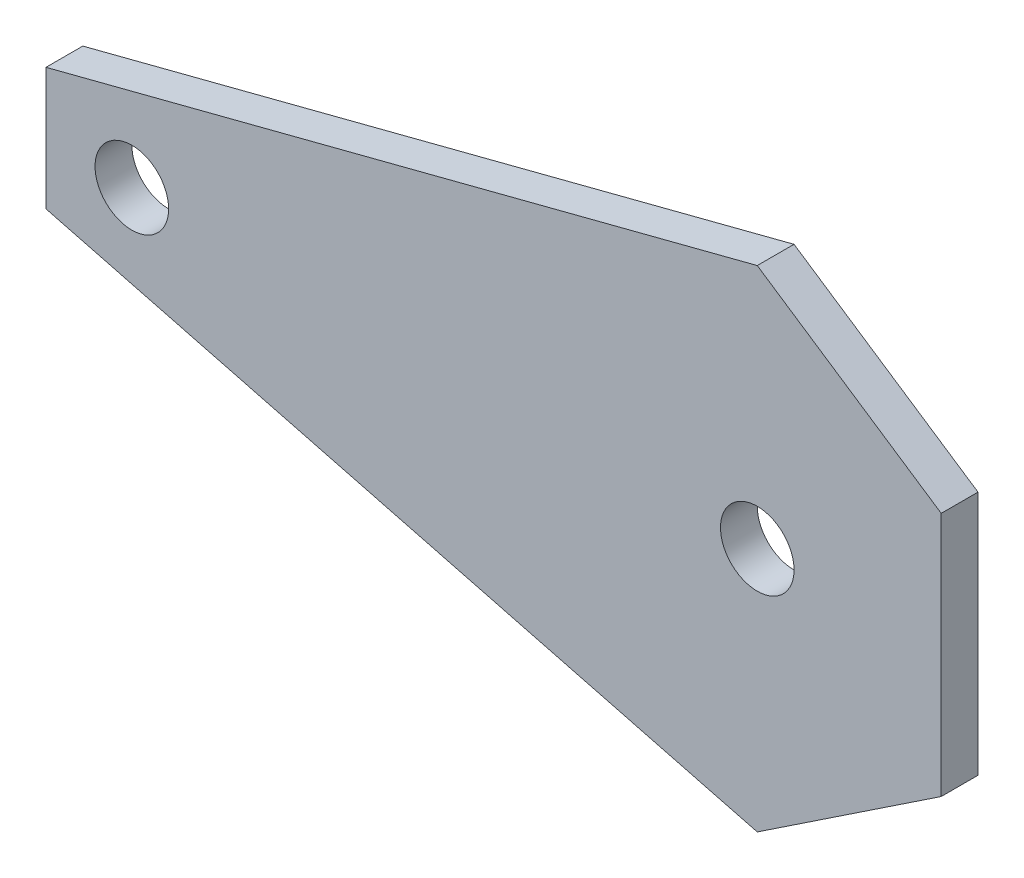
ISO-10303-21;
HEADER;
FILE_DESCRIPTION(('STEP AP214'),'2;1');
FILE_NAME('part.step','',(''),(''),'','','');
FILE_SCHEMA(('AUTOMOTIVE_DESIGN { 1 0 10303 214 1 1 1 1 }'));
ENDSEC;
DATA;
#1=APPLICATION_CONTEXT('core data for automotive mechanical design processes');
#2=APPLICATION_PROTOCOL_DEFINITION('international standard','automotive_design',2000,#1);
#3=PRODUCT_CONTEXT('',#1,'mechanical');
#4=PRODUCT('Part','Part','',(#3));
#5=PRODUCT_RELATED_PRODUCT_CATEGORY('part','',(#4));
#6=PRODUCT_DEFINITION_FORMATION('','',#4);
#7=PRODUCT_DEFINITION_CONTEXT('part definition',#1,'design');
#8=PRODUCT_DEFINITION('design','',#6,#7);
#9=PRODUCT_DEFINITION_SHAPE('','',#8);
#10=(LENGTH_UNIT() NAMED_UNIT(*) SI_UNIT(.MILLI.,.METRE.));
#11=(NAMED_UNIT(*) PLANE_ANGLE_UNIT() SI_UNIT($,.RADIAN.));
#12=(NAMED_UNIT(*) SI_UNIT($,.STERADIAN.) SOLID_ANGLE_UNIT());
#13=UNCERTAINTY_MEASURE_WITH_UNIT(LENGTH_MEASURE(1.E-05),#10,'distance_accuracy_value','');
#14=(GEOMETRIC_REPRESENTATION_CONTEXT(3) GLOBAL_UNCERTAINTY_ASSIGNED_CONTEXT((#13)) GLOBAL_UNIT_ASSIGNED_CONTEXT((#10,
#11,#12)) REPRESENTATION_CONTEXT('',''));
#15=CARTESIAN_POINT('',(0.,0.,0.));
#16=DIRECTION('',(0.,0.,1.));
#17=DIRECTION('',(1.,0.,0.));
#18=AXIS2_PLACEMENT_3D('',#15,#16,#17);
#19=CARTESIAN_POINT('',(30.,0.,3.));
#20=DIRECTION('',(0.,0.,-1.));
#21=DIRECTION('',(-1.,0.,0.));
#22=AXIS2_PLACEMENT_3D('',#19,#20,#21);
#23=PLANE('',#22);
#24=CARTESIAN_POINT('',(0.,0.,3.));
#25=DIRECTION('',(0.,0.,1.));
#26=DIRECTION('',(1.,0.,0.));
#27=AXIS2_PLACEMENT_3D('',#24,#25,#26);
#28=CIRCLE('',#27,3.);
#29=CARTESIAN_POINT('',(3.,0.,3.));
#30=VERTEX_POINT('',#29);
#31=EDGE_CURVE('E121',#30,#30,#28,.T.);
#32=ORIENTED_EDGE('',*,*,#31,.F.);
#33=EDGE_LOOP('',(#32));
#34=FACE_BOUND('',#33,.T.);
#35=DIRECTION('',(-0.832050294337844,0.554700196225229,0.));
#36=VECTOR('',#35,1.);
#37=CARTESIAN_POINT('',(0.,20.,3.));
#38=LINE('',#37,#36);
#39=CARTESIAN_POINT('',(15.,10.,3.));
#40=VERTEX_POINT('',#39);
#41=CARTESIAN_POINT('',(0.,20.,3.));
#42=VERTEX_POINT('',#41);
#43=EDGE_CURVE('E128',#40,#42,#38,.T.);
#44=ORIENTED_EDGE('',*,*,#43,.T.);
#45=DIRECTION('',(-0.968146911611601,-0.250382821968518,0.));
#46=VECTOR('',#45,1.);
#47=CARTESIAN_POINT('',(-58.,5.,3.));
#48=LINE('',#47,#46);
#49=CARTESIAN_POINT('',(-58.,5.,3.));
#50=VERTEX_POINT('',#49);
#51=EDGE_CURVE('E86',#42,#50,#48,.T.);
#52=ORIENTED_EDGE('',*,*,#51,.T.);
#53=DIRECTION('',(0.,-1.,0.));
#54=VECTOR('',#53,1.);
#55=CARTESIAN_POINT('',(-58.,-5.,3.));
#56=LINE('',#55,#54);
#57=CARTESIAN_POINT('',(-58.,-5.,3.));
#58=VERTEX_POINT('',#57);
#59=EDGE_CURVE('E99',#50,#58,#56,.T.);
#60=ORIENTED_EDGE('',*,*,#59,.T.);
#61=DIRECTION('',(0.968146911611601,-0.250382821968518,0.));
#62=VECTOR('',#61,1.);
#63=CARTESIAN_POINT('',(0.,-20.,3.));
#64=LINE('',#63,#62);
#65=CARTESIAN_POINT('',(0.,-20.,3.));
#66=VERTEX_POINT('',#65);
#67=EDGE_CURVE('E93',#58,#66,#64,.T.);
#68=ORIENTED_EDGE('',*,*,#67,.T.);
#69=DIRECTION('',(0.832050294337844,0.554700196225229,0.));
#70=VECTOR('',#69,1.);
#71=CARTESIAN_POINT('',(15.,-10.,3.));
#72=LINE('',#71,#70);
#73=CARTESIAN_POINT('',(15.,-10.,3.));
#74=VERTEX_POINT('',#73);
#75=EDGE_CURVE('E97',#66,#74,#72,.T.);
#76=ORIENTED_EDGE('',*,*,#75,.T.);
#77=DIRECTION('',(0.,1.,0.));
#78=VECTOR('',#77,1.);
#79=CARTESIAN_POINT('',(15.,10.,3.));
#80=LINE('',#79,#78);
#81=EDGE_CURVE('E49',#74,#40,#80,.T.);
#82=ORIENTED_EDGE('',*,*,#81,.T.);
#83=EDGE_LOOP('',(#44,#52,#60,#68,#76,#82));
#84=FACE_BOUND('',#83,.T.);
#85=CARTESIAN_POINT('',(-51.,0.,3.));
#86=DIRECTION('',(0.,0.,1.));
#87=DIRECTION('',(1.,0.,0.));
#88=AXIS2_PLACEMENT_3D('',#85,#86,#87);
#89=CIRCLE('',#88,3.);
#90=CARTESIAN_POINT('',(-48.,0.,3.));
#91=VERTEX_POINT('',#90);
#92=EDGE_CURVE('E171',#91,#91,#89,.T.);
#93=ORIENTED_EDGE('',*,*,#92,.F.);
#94=EDGE_LOOP('',(#93));
#95=FACE_BOUND('',#94,.T.);
#96=ADVANCED_FACE('F32',(#34,#84,#95),#23,.F.);
#97=CARTESIAN_POINT('',(30.,0.,0.));
#98=DIRECTION('',(0.,0.,-1.));
#99=DIRECTION('',(-1.,0.,0.));
#100=AXIS2_PLACEMENT_3D('',#97,#98,#99);
#101=PLANE('',#100);
#102=CARTESIAN_POINT('',(0.,0.,0.));
#103=DIRECTION('',(0.,0.,1.));
#104=DIRECTION('',(1.,0.,0.));
#105=AXIS2_PLACEMENT_3D('',#102,#103,#104);
#106=CIRCLE('',#105,3.);
#107=CARTESIAN_POINT('',(3.,0.,0.));
#108=VERTEX_POINT('',#107);
#109=EDGE_CURVE('E176',#108,#108,#106,.T.);
#110=ORIENTED_EDGE('',*,*,#109,.T.);
#111=EDGE_LOOP('',(#110));
#112=FACE_BOUND('',#111,.T.);
#113=DIRECTION('',(-0.832050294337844,0.554700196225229,0.));
#114=VECTOR('',#113,1.);
#115=CARTESIAN_POINT('',(0.,20.,0.));
#116=LINE('',#115,#114);
#117=CARTESIAN_POINT('',(15.,10.,0.));
#118=VERTEX_POINT('',#117);
#119=CARTESIAN_POINT('',(0.,20.,0.));
#120=VERTEX_POINT('',#119);
#121=EDGE_CURVE('E117',#118,#120,#116,.T.);
#122=ORIENTED_EDGE('',*,*,#121,.F.);
#123=DIRECTION('',(0.,1.,0.));
#124=VECTOR('',#123,1.);
#125=CARTESIAN_POINT('',(15.,10.,0.));
#126=LINE('',#125,#124);
#127=CARTESIAN_POINT('',(15.,-10.,0.));
#128=VERTEX_POINT('',#127);
#129=EDGE_CURVE('E78',#128,#118,#126,.T.);
#130=ORIENTED_EDGE('',*,*,#129,.F.);
#131=DIRECTION('',(0.832050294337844,0.554700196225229,0.));
#132=VECTOR('',#131,1.);
#133=CARTESIAN_POINT('',(15.,-10.,0.));
#134=LINE('',#133,#132);
#135=CARTESIAN_POINT('',(0.,-20.,0.));
#136=VERTEX_POINT('',#135);
#137=EDGE_CURVE('E72',#136,#128,#134,.T.);
#138=ORIENTED_EDGE('',*,*,#137,.F.);
#139=DIRECTION('',(0.968146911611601,-0.250382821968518,0.));
#140=VECTOR('',#139,1.);
#141=CARTESIAN_POINT('',(0.,-20.,0.));
#142=LINE('',#141,#140);
#143=CARTESIAN_POINT('',(-58.,-5.,0.));
#144=VERTEX_POINT('',#143);
#145=EDGE_CURVE('E107',#144,#136,#142,.T.);
#146=ORIENTED_EDGE('',*,*,#145,.F.);
#147=DIRECTION('',(0.,-1.,0.));
#148=VECTOR('',#147,1.);
#149=CARTESIAN_POINT('',(-58.,-5.,0.));
#150=LINE('',#149,#148);
#151=CARTESIAN_POINT('',(-58.,5.,0.));
#152=VERTEX_POINT('',#151);
#153=EDGE_CURVE('E123',#152,#144,#150,.T.);
#154=ORIENTED_EDGE('',*,*,#153,.F.);
#155=DIRECTION('',(-0.968146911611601,-0.250382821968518,0.));
#156=VECTOR('',#155,1.);
#157=CARTESIAN_POINT('',(-58.,5.,0.));
#158=LINE('',#157,#156);
#159=EDGE_CURVE('E120',#120,#152,#158,.T.);
#160=ORIENTED_EDGE('',*,*,#159,.F.);
#161=EDGE_LOOP('',(#122,#130,#138,#146,#154,#160));
#162=FACE_BOUND('',#161,.T.);
#163=CARTESIAN_POINT('',(-51.,0.,0.));
#164=DIRECTION('',(0.,0.,1.));
#165=DIRECTION('',(1.,0.,0.));
#166=AXIS2_PLACEMENT_3D('',#163,#164,#165);
#167=CIRCLE('',#166,3.);
#168=CARTESIAN_POINT('',(-48.,0.,0.));
#169=VERTEX_POINT('',#168);
#170=EDGE_CURVE('E174',#169,#169,#167,.T.);
#171=ORIENTED_EDGE('',*,*,#170,.T.);
#172=EDGE_LOOP('',(#171));
#173=FACE_BOUND('',#172,.T.);
#174=ADVANCED_FACE('F137',(#112,#162,#173),#101,.T.);
#175=CARTESIAN_POINT('',(0.,20.,3.));
#176=DIRECTION('',(-0.554700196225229,-0.832050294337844,0.));
#177=DIRECTION('',(0.832050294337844,-0.554700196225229,0.));
#178=AXIS2_PLACEMENT_3D('',#175,#176,#177);
#179=PLANE('',#178);
#180=ORIENTED_EDGE('',*,*,#121,.T.);
#181=DIRECTION('',(0.,0.,-1.));
#182=VECTOR('',#181,1.);
#183=CARTESIAN_POINT('',(0.,20.,3.));
#184=LINE('',#183,#182);
#185=EDGE_CURVE('E11',#42,#120,#184,.T.);
#186=ORIENTED_EDGE('',*,*,#185,.F.);
#187=ORIENTED_EDGE('',*,*,#43,.F.);
#188=DIRECTION('',(0.,0.,-1.));
#189=VECTOR('',#188,1.);
#190=CARTESIAN_POINT('',(15.,10.,3.));
#191=LINE('',#190,#189);
#192=EDGE_CURVE('E113',#40,#118,#191,.T.);
#193=ORIENTED_EDGE('',*,*,#192,.T.);
#194=EDGE_LOOP('',(#180,#186,#187,#193));
#195=FACE_BOUND('',#194,.T.);
#196=ADVANCED_FACE('F34',(#195),#179,.F.);
#197=CARTESIAN_POINT('',(-58.,5.,3.));
#198=DIRECTION('',(0.250382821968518,-0.968146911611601,0.));
#199=DIRECTION('',(0.968146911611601,0.250382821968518,0.));
#200=AXIS2_PLACEMENT_3D('',#197,#198,#199);
#201=PLANE('',#200);
#202=ORIENTED_EDGE('',*,*,#159,.T.);
#203=DIRECTION('',(0.,0.,-1.));
#204=VECTOR('',#203,1.);
#205=CARTESIAN_POINT('',(-58.,5.,3.));
#206=LINE('',#205,#204);
#207=EDGE_CURVE('E41',#50,#152,#206,.T.);
#208=ORIENTED_EDGE('',*,*,#207,.F.);
#209=ORIENTED_EDGE('',*,*,#51,.F.);
#210=ORIENTED_EDGE('',*,*,#185,.T.);
#211=EDGE_LOOP('',(#202,#208,#209,#210));
#212=FACE_BOUND('',#211,.T.);
#213=ADVANCED_FACE('F217',(#212),#201,.F.);
#214=CARTESIAN_POINT('',(-58.,-5.,3.));
#215=DIRECTION('',(1.,0.,0.));
#216=DIRECTION('',(0.,0.,-1.));
#217=AXIS2_PLACEMENT_3D('',#214,#215,#216);
#218=PLANE('',#217);
#219=ORIENTED_EDGE('',*,*,#153,.T.);
#220=DIRECTION('',(0.,0.,-1.));
#221=VECTOR('',#220,1.);
#222=CARTESIAN_POINT('',(-58.,-5.,3.));
#223=LINE('',#222,#221);
#224=EDGE_CURVE('E108',#58,#144,#223,.T.);
#225=ORIENTED_EDGE('',*,*,#224,.F.);
#226=ORIENTED_EDGE('',*,*,#59,.F.);
#227=ORIENTED_EDGE('',*,*,#207,.T.);
#228=EDGE_LOOP('',(#219,#225,#226,#227));
#229=FACE_BOUND('',#228,.T.);
#230=ADVANCED_FACE('F134',(#229),#218,.F.);
#231=CARTESIAN_POINT('',(0.,-20.,3.));
#232=DIRECTION('',(0.250382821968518,0.968146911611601,0.));
#233=DIRECTION('',(-0.968146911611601,0.250382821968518,0.));
#234=AXIS2_PLACEMENT_3D('',#231,#232,#233);
#235=PLANE('',#234);
#236=ORIENTED_EDGE('',*,*,#145,.T.);
#237=DIRECTION('',(0.,0.,-1.));
#238=VECTOR('',#237,1.);
#239=CARTESIAN_POINT('',(0.,-20.,3.));
#240=LINE('',#239,#238);
#241=EDGE_CURVE('E104',#66,#136,#240,.T.);
#242=ORIENTED_EDGE('',*,*,#241,.F.);
#243=ORIENTED_EDGE('',*,*,#67,.F.);
#244=ORIENTED_EDGE('',*,*,#224,.T.);
#245=EDGE_LOOP('',(#236,#242,#243,#244));
#246=FACE_BOUND('',#245,.T.);
#247=ADVANCED_FACE('F105',(#246),#235,.F.);
#248=CARTESIAN_POINT('',(15.,-10.,3.));
#249=DIRECTION('',(-0.554700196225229,0.832050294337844,0.));
#250=DIRECTION('',(-0.832050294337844,-0.554700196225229,0.));
#251=AXIS2_PLACEMENT_3D('',#248,#249,#250);
#252=PLANE('',#251);
#253=ORIENTED_EDGE('',*,*,#137,.T.);
#254=DIRECTION('',(0.,0.,-1.));
#255=VECTOR('',#254,1.);
#256=CARTESIAN_POINT('',(15.,-10.,3.));
#257=LINE('',#256,#255);
#258=EDGE_CURVE('E109',#74,#128,#257,.T.);
#259=ORIENTED_EDGE('',*,*,#258,.F.);
#260=ORIENTED_EDGE('',*,*,#75,.F.);
#261=ORIENTED_EDGE('',*,*,#241,.T.);
#262=EDGE_LOOP('',(#253,#259,#260,#261));
#263=FACE_BOUND('',#262,.T.);
#264=ADVANCED_FACE('F111',(#263),#252,.F.);
#265=CARTESIAN_POINT('',(15.,10.,3.));
#266=DIRECTION('',(-1.,0.,0.));
#267=DIRECTION('',(0.,0.,1.));
#268=AXIS2_PLACEMENT_3D('',#265,#266,#267);
#269=PLANE('',#268);
#270=ORIENTED_EDGE('',*,*,#129,.T.);
#271=ORIENTED_EDGE('',*,*,#192,.F.);
#272=ORIENTED_EDGE('',*,*,#81,.F.);
#273=ORIENTED_EDGE('',*,*,#258,.T.);
#274=EDGE_LOOP('',(#270,#271,#272,#273));
#275=FACE_BOUND('',#274,.T.);
#276=ADVANCED_FACE('F142',(#275),#269,.F.);
#277=CARTESIAN_POINT('',(0.,0.,3.));
#278=DIRECTION('',(0.,0.,-1.));
#279=DIRECTION('',(-1.,0.,0.));
#280=AXIS2_PLACEMENT_3D('',#277,#278,#279);
#281=CYLINDRICAL_SURFACE('',#280,3.);
#282=ORIENTED_EDGE('',*,*,#31,.T.);
#283=EDGE_LOOP('',(#282));
#284=FACE_BOUND('',#283,.T.);
#285=ORIENTED_EDGE('',*,*,#109,.F.);
#286=EDGE_LOOP('',(#285));
#287=FACE_BOUND('',#286,.T.);
#288=ADVANCED_FACE('F144',(#284,#287),#281,.F.);
#289=CARTESIAN_POINT('',(-51.,0.,3.));
#290=DIRECTION('',(0.,0.,-1.));
#291=DIRECTION('',(-1.,0.,0.));
#292=AXIS2_PLACEMENT_3D('',#289,#290,#291);
#293=CYLINDRICAL_SURFACE('',#292,3.);
#294=ORIENTED_EDGE('',*,*,#92,.T.);
#295=EDGE_LOOP('',(#294));
#296=FACE_BOUND('',#295,.T.);
#297=ORIENTED_EDGE('',*,*,#170,.F.);
#298=EDGE_LOOP('',(#297));
#299=FACE_BOUND('',#298,.T.);
#300=ADVANCED_FACE('F150',(#296,#299),#293,.F.);
#301=CLOSED_SHELL('',(#96,#174,#196,#213,#230,#247,#264,#276,#288,#300));
#302=MANIFOLD_SOLID_BREP('B2',#301);
#303=ADVANCED_BREP_SHAPE_REPRESENTATION('',(#18,#302),#14);
#304=SHAPE_DEFINITION_REPRESENTATION(#9,#303);
ENDSEC;
END-ISO-10303-21;
